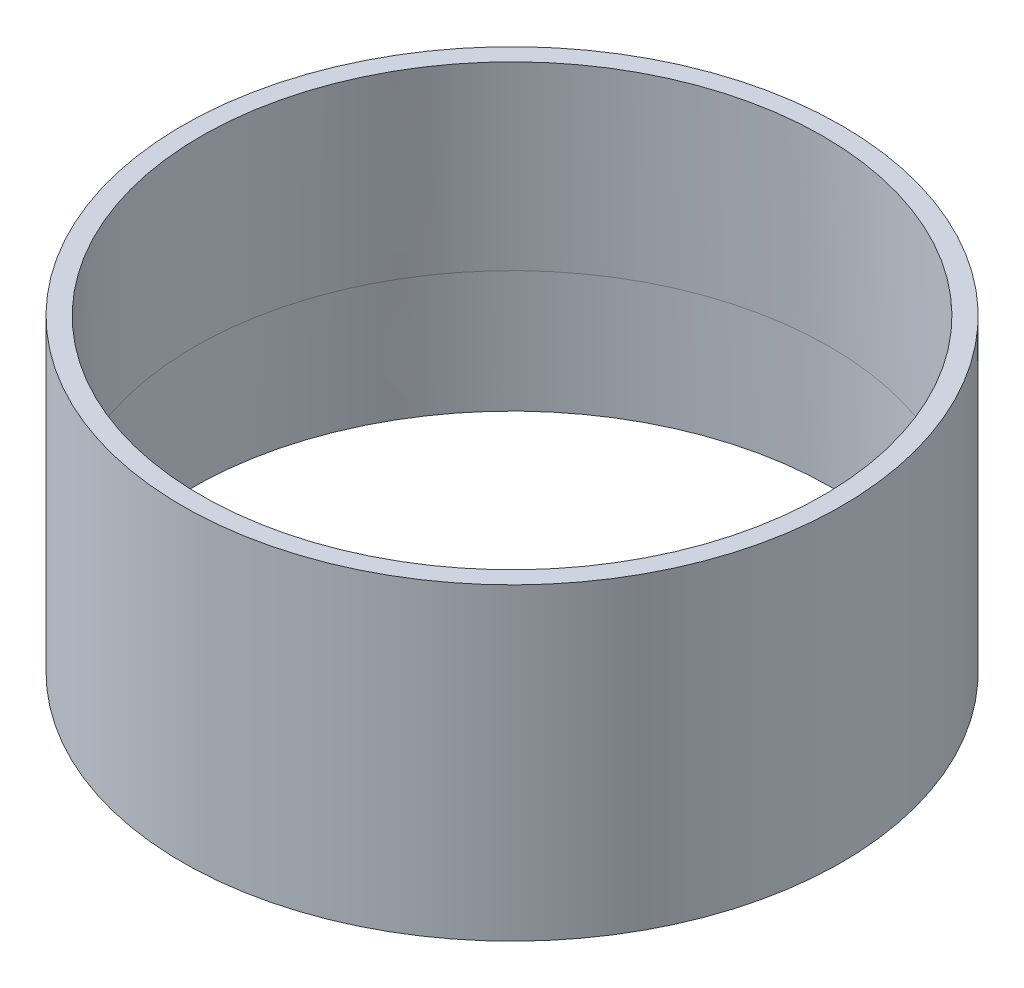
ISO-10303-21;
HEADER;
FILE_DESCRIPTION(('STEP AP214'),'2;1');
FILE_NAME('part.step','',(''),(''),'','','');
FILE_SCHEMA(('AUTOMOTIVE_DESIGN { 1 0 10303 214 1 1 1 1 }'));
ENDSEC;
DATA;
#1=APPLICATION_CONTEXT('core data for automotive mechanical design processes');
#2=APPLICATION_PROTOCOL_DEFINITION('international standard','automotive_design',2000,#1);
#3=PRODUCT_CONTEXT('',#1,'mechanical');
#4=PRODUCT('Part','Part','',(#3));
#5=PRODUCT_RELATED_PRODUCT_CATEGORY('part','',(#4));
#6=PRODUCT_DEFINITION_FORMATION('','',#4);
#7=PRODUCT_DEFINITION_CONTEXT('part definition',#1,'design');
#8=PRODUCT_DEFINITION('design','',#6,#7);
#9=PRODUCT_DEFINITION_SHAPE('','',#8);
#10=(LENGTH_UNIT() NAMED_UNIT(*) SI_UNIT(.MILLI.,.METRE.));
#11=(NAMED_UNIT(*) PLANE_ANGLE_UNIT() SI_UNIT($,.RADIAN.));
#12=(NAMED_UNIT(*) SI_UNIT($,.STERADIAN.) SOLID_ANGLE_UNIT());
#13=UNCERTAINTY_MEASURE_WITH_UNIT(LENGTH_MEASURE(1.E-05),#10,'distance_accuracy_value','');
#14=(GEOMETRIC_REPRESENTATION_CONTEXT(3) GLOBAL_UNCERTAINTY_ASSIGNED_CONTEXT((#13)) GLOBAL_UNIT_ASSIGNED_CONTEXT((#10,
#11,#12)) REPRESENTATION_CONTEXT('',''));
#15=CARTESIAN_POINT('',(0.,0.,0.));
#16=DIRECTION('',(0.,0.,1.));
#17=DIRECTION('',(1.,0.,0.));
#18=AXIS2_PLACEMENT_3D('',#15,#16,#17);
#19=CARTESIAN_POINT('',(25.2,60.,0.));
#20=DIRECTION('',(0.,1.,0.));
#21=DIRECTION('',(0.,0.,1.));
#22=AXIS2_PLACEMENT_3D('',#19,#20,#21);
#23=PLANE('',#22);
#24=CARTESIAN_POINT('',(0.,60.,0.));
#25=DIRECTION('',(0.,-1.,0.));
#26=DIRECTION('',(0.,0.,-1.));
#27=AXIS2_PLACEMENT_3D('',#24,#25,#26);
#28=CIRCLE('',#27,25.2);
#29=CARTESIAN_POINT('',(0.,60.,-25.2));
#30=VERTEX_POINT('',#29);
#31=EDGE_CURVE('E59',#30,#30,#28,.T.);
#32=ORIENTED_EDGE('',*,*,#31,.T.);
#33=EDGE_LOOP('',(#32));
#34=FACE_BOUND('',#33,.T.);
#35=CARTESIAN_POINT('',(0.,60.,0.));
#36=DIRECTION('',(0.,-1.,0.));
#37=DIRECTION('',(0.,0.,-1.));
#38=AXIS2_PLACEMENT_3D('',#35,#36,#37);
#39=CIRCLE('',#38,26.7);
#40=CARTESIAN_POINT('',(0.,60.,-26.7));
#41=VERTEX_POINT('',#40);
#42=EDGE_CURVE('E10',#41,#41,#39,.T.);
#43=ORIENTED_EDGE('',*,*,#42,.F.);
#44=EDGE_LOOP('',(#43));
#45=FACE_BOUND('',#44,.T.);
#46=ADVANCED_FACE('F40',(#34,#45),#23,.T.);
#47=CARTESIAN_POINT('',(0.,0.,0.));
#48=DIRECTION('',(0.,-1.,0.));
#49=DIRECTION('',(0.,0.,-1.));
#50=AXIS2_PLACEMENT_3D('',#47,#48,#49);
#51=CYLINDRICAL_SURFACE('',#50,26.7);
#52=ORIENTED_EDGE('',*,*,#42,.T.);
#53=EDGE_LOOP('',(#52));
#54=FACE_BOUND('',#53,.T.);
#55=CARTESIAN_POINT('',(0.,35.,0.));
#56=DIRECTION('',(0.,-1.,0.));
#57=DIRECTION('',(0.,0.,-1.));
#58=AXIS2_PLACEMENT_3D('',#55,#56,#57);
#59=CIRCLE('',#58,26.7);
#60=CARTESIAN_POINT('',(0.,35.,-26.7));
#61=VERTEX_POINT('',#60);
#62=EDGE_CURVE('E46',#61,#61,#59,.T.);
#63=ORIENTED_EDGE('',*,*,#62,.F.);
#64=EDGE_LOOP('',(#63));
#65=FACE_BOUND('',#64,.T.);
#66=ADVANCED_FACE('F77',(#54,#65),#51,.T.);
#67=CARTESIAN_POINT('',(25.9,35.,0.));
#68=DIRECTION('',(0.,-1.,0.));
#69=DIRECTION('',(0.,0.,-1.));
#70=AXIS2_PLACEMENT_3D('',#67,#68,#69);
#71=PLANE('',#70);
#72=ORIENTED_EDGE('',*,*,#62,.T.);
#73=EDGE_LOOP('',(#72));
#74=FACE_BOUND('',#73,.T.);
#75=CARTESIAN_POINT('',(0.,35.,0.));
#76=DIRECTION('',(0.,-1.,0.));
#77=DIRECTION('',(0.,0.,-1.));
#78=AXIS2_PLACEMENT_3D('',#75,#76,#77);
#79=CIRCLE('',#78,25.9);
#80=CARTESIAN_POINT('',(0.,35.,-25.9));
#81=VERTEX_POINT('',#80);
#82=EDGE_CURVE('E50',#81,#81,#79,.T.);
#83=ORIENTED_EDGE('',*,*,#82,.F.);
#84=EDGE_LOOP('',(#83));
#85=FACE_BOUND('',#84,.T.);
#86=ADVANCED_FACE('F73',(#74,#85),#71,.T.);
#87=CARTESIAN_POINT('',(0.,44.99799979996,0.));
#88=DIRECTION('',(0.,-1.,0.));
#89=DIRECTION('',(0.,0.,-1.));
#90=AXIS2_PLACEMENT_3D('',#87,#88,#89);
#91=CONICAL_SURFACE('',#90,25.7,0.0200013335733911);
#92=ORIENTED_EDGE('',*,*,#82,.T.);
#93=EDGE_LOOP('',(#92));
#94=FACE_BOUND('',#93,.T.);
#95=CARTESIAN_POINT('',(0.,44.99799979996,0.));
#96=DIRECTION('',(0.,-1.,0.));
#97=DIRECTION('',(0.,0.,-1.));
#98=AXIS2_PLACEMENT_3D('',#95,#96,#97);
#99=CIRCLE('',#98,25.7);
#100=CARTESIAN_POINT('',(0.,44.99799979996,-25.7));
#101=VERTEX_POINT('',#100);
#102=EDGE_CURVE('E54',#101,#101,#99,.T.);
#103=ORIENTED_EDGE('',*,*,#102,.F.);
#104=EDGE_LOOP('',(#103));
#105=FACE_BOUND('',#104,.T.);
#106=ADVANCED_FACE('F67',(#94,#105),#91,.F.);
#107=CARTESIAN_POINT('',(0.,60.,0.));
#108=DIRECTION('',(0.,-1.,0.));
#109=DIRECTION('',(0.,0.,-1.));
#110=AXIS2_PLACEMENT_3D('',#107,#108,#109);
#111=CONICAL_SURFACE('',#110,25.2,0.033316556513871);
#112=ORIENTED_EDGE('',*,*,#102,.T.);
#113=EDGE_LOOP('',(#112));
#114=FACE_BOUND('',#113,.T.);
#115=ORIENTED_EDGE('',*,*,#31,.F.);
#116=EDGE_LOOP('',(#115));
#117=FACE_BOUND('',#116,.T.);
#118=ADVANCED_FACE('F65',(#114,#117),#111,.F.);
#119=CLOSED_SHELL('',(#46,#66,#86,#106,#118));
#120=MANIFOLD_SOLID_BREP('B2',#119);
#121=ADVANCED_BREP_SHAPE_REPRESENTATION('',(#18,#120),#14);
#122=SHAPE_DEFINITION_REPRESENTATION(#9,#121);
ENDSEC;
END-ISO-10303-21;
